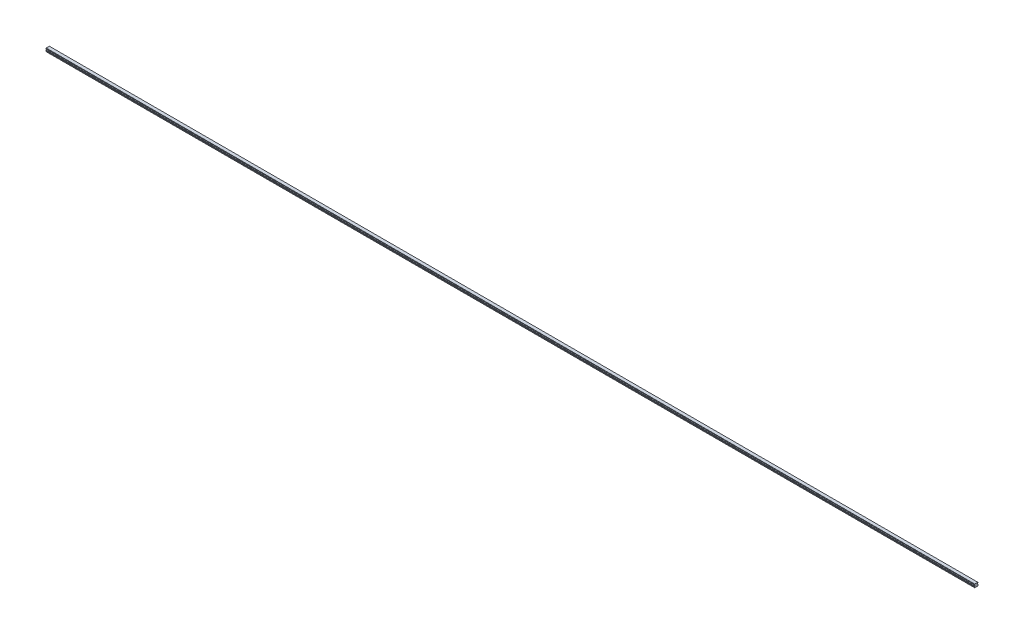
from build123d import *

# Parameters (mm, degrees)
BOSS_EXTRUDE1_DEPTH        = 3900
SKETCH3_R                  = 2.5
SKETCH3_R_2                = 2.1
CUT_EXTRUDE3_DEPTH         = 7
SKETCH3_2_R                = 2.1
CUT_EXTRUDE4_DEPTH         = 9.5
CHAMFER1_SIZE              = 0.4
LPATTERN2_COUNT            = 65
LPATTERN2_PITCH            = 60
CHAMFER1_OF_LPATTERN2_SIZE = 0.4


with BuildPart() as part:
    # Sketch1 → Boss-Extrude1 (new body)
    with BuildSketch(Plane(origin=(0, 0, 0), x_dir=(0, 0, -1), z_dir=(1, 0, 0))):
        with BuildLine():
            Line((6.59, 14), (-6.59, 14))
            Line((-6.59, 14), (-6.59, 13.15))
            Line((-6.59, 13.15), (-6.96, 12.356532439))
            Line((-6.96, 12.356532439), (-6.96, 11.435174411))
            ThreePointArc((-6.96, 11.435174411), (-5.25, 9.5), (-6.96, 7.564825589))
            Line((-6.96, 7.564825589), (-6.96, 6.643467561))
            Line((-6.96, 6.643467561), (-6.59, 5.85))
            Line((-6.59, 5.85), (-7.032116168, 4.2))
            Line((-7.032116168, 4.2), (-7.5, 3.929867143))
            Line((-7.5, 3.929867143), (-7.5, 1.4))
            Line((-7.5, 1.4), (-6.1, 0))
            Line((-6.1, 0), (-3.65, 0))
            Line((-3.65, 0), (-3.25, 0.4))
            Line((-3.25, 0.4), (3.25, 0.4))
            Line((3.25, 0.4), (3.65, 0))
            Line((3.65, 0), (6.1, 0))
            Line((6.1, 0), (7.5, 1.4))
            Line((7.5, 1.4), (7.5, 3.929867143))
            Line((7.5, 3.929867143), (7.032116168, 4.2))
            Line((7.032116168, 4.2), (6.59, 5.85))
            Line((6.59, 5.85), (6.96, 6.643467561))
            Line((6.96, 6.643467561), (6.96, 7.564825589))
            ThreePointArc((6.96, 7.564825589), (5.25, 9.5), (6.96, 11.435174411))
            Line((6.96, 11.435174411), (6.96, 12.356532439))
            Line((6.96, 12.356532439), (6.59, 13.15))
            Line((6.59, 13.15), (6.59, 14))
        make_face()
    extrude(amount=BOSS_EXTRUDE1_DEPTH)

    # Sketch3 → Cut-Extrude3 (cut)
    with BuildSketch(Plane.XZ):
        with Locations(Location((30, 0, 0), (0, 0, 270))):
            Circle(SKETCH3_R)
        with Locations(Location((30, 0, 0), (0, 0, 270))):
            Circle(SKETCH3_R_2, mode=Mode.SUBTRACT)
    cut_extrude3 = extrude(amount=-CUT_EXTRUDE3_DEPTH, mode=Mode.SUBTRACT)

    # Sketch3_2 → Cut-Extrude4 (cut)
    with BuildSketch(Plane.XZ):
        with Locations(Location((30, 0, 0), (0, 0, 270))):
            Circle(SKETCH3_2_R)
    cut_extrude4 = extrude(amount=-CUT_EXTRUDE4_DEPTH, mode=Mode.SUBTRACT)

    # Cut-Extrude5 cone 1 section (on through the dimple's axis) → Cut-Extrude5 (revolve, cut)
    with BuildSketch(Plane(origin=(30, 9.5, 0), x_dir=(0, 0, -1), z_dir=(1, 0, 0))):
        Polygon((0, 0), (2.1, 0), (0, 1.212435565), align=None)
    revolve(axis=Axis((30, 9.5, 0), (0, 1, 0)), mode=Mode.SUBTRACT)

    # Chamfer1
    chamfer1_edges = [part.edges().sort_by_distance(p)[0] for p in [
        (30, 0.4, 2.5),
    ]]
    chamfer(chamfer1_edges, length=CHAMFER1_SIZE)

    # LPattern2: Cut-Extrude3, Cut-Extrude4 ×65
    with Locations(*[(i * LPATTERN2_PITCH, 0, 0) for i in range(1, LPATTERN2_COUNT)]):
        add(cut_extrude3, mode=Mode.SUBTRACT)
        add(cut_extrude4, mode=Mode.SUBTRACT)

    # Chamfer1 of LPattern2
    chamfer1_of_lpattern2_edges = [part.edges().sort_by_distance(p)[0] for p in [
        (90, 0.4, 2.5),
        (150, 0.4, 2.5),
        (210, 0.4, 2.5),
        (270, 0.4, 2.5),
        (330, 0.4, 2.5),
        (390, 0.4, 2.5),
        (450, 0.4, 2.5),
        (510, 0.4, 2.5),
        (570, 0.4, 2.5),
        (630, 0.4, 2.5),
        (690, 0.4, 2.5),
        (750, 0.4, 2.5),
        (810, 0.4, 2.5),
        (870, 0.4, 2.5),
        (930, 0.4, 2.5),
        (990, 0.4, 2.5),
        (1050, 0.4, 2.5),
        (1110, 0.4, 2.5),
        (1170, 0.4, 2.5),
        (1230, 0.4, 2.5),
        (1290, 0.4, 2.5),
        (1350, 0.4, 2.5),
        (1410, 0.4, 2.5),
        (1470, 0.4, 2.5),
        (1530, 0.4, 2.5),
        (1590, 0.4, 2.5),
        (1650, 0.4, 2.5),
        (1710, 0.4, 2.5),
        (1770, 0.4, 2.5),
        (1830, 0.4, 2.5),
        (1890, 0.4, 2.5),
        (1950, 0.4, 2.5),
        (2010, 0.4, 2.5),
        (2070, 0.4, 2.5),
        (2130, 0.4, 2.5),
        (2190, 0.4, 2.5),
        (2250, 0.4, 2.5),
        (2310, 0.4, 2.5),
        (2370, 0.4, 2.5),
        (2430, 0.4, 2.5),
        (2490, 0.4, 2.5),
        (2550, 0.4, 2.5),
        (2610, 0.4, 2.5),
        (2670, 0.4, 2.5),
        (2730, 0.4, 2.5),
        (2790, 0.4, 2.5),
        (2850, 0.4, 2.5),
        (2910, 0.4, 2.5),
        (2970, 0.4, 2.5),
        (3030, 0.4, 2.5),
        (3090, 0.4, 2.5),
        (3150, 0.4, 2.5),
        (3210, 0.4, 2.5),
        (3270, 0.4, 2.5),
        (3330, 0.4, 2.5),
        (3390, 0.4, 2.5),
        (3450, 0.4, 2.5),
        (3510, 0.4, 2.5),
        (3570, 0.4, 2.5),
        (3630, 0.4, 2.5),
        (3690, 0.4, 2.5),
        (3750, 0.4, 2.5),
        (3810, 0.4, 2.5),
        (3870, 0.4, 2.5),
    ]]
    chamfer(chamfer1_of_lpattern2_edges, length=CHAMFER1_OF_LPATTERN2_SIZE)


solid = part.part
